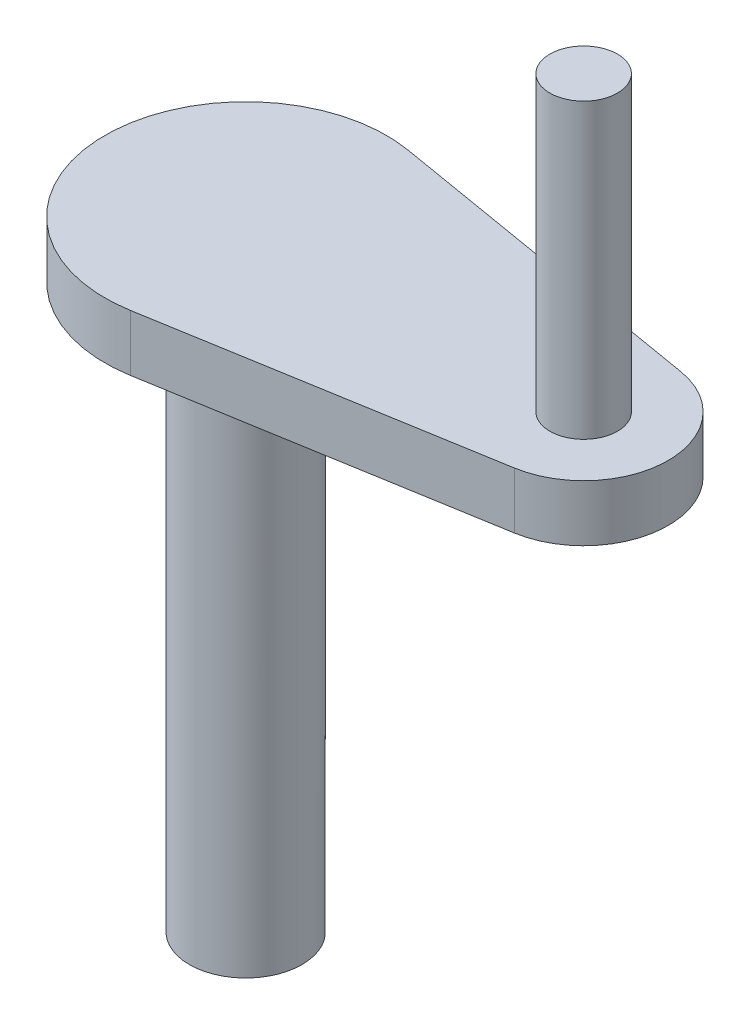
from build123d import *

# Parameters (mm, degrees)
LINEAR_AUSTRAGEN1_DEPTH = 10
SKIZZE3_R               = 6
LINEAR_AUSTRAGEN2_DEPTH = 52
SKIZZE4_R               = 10
LINEAR_AUSTRAGEN3_DEPTH = 100


with BuildPart() as part:
    # Skizze2 → Linear austragen1 (new body)
    with BuildSketch(Plane(origin=(0, 90.376129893, 0), x_dir=(-1, 0, 0), z_dir=(0, 1, 0))):
        with BuildLine():
            Line((17.973666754, 24.65033243), (-40.35966658, 14.790199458))
            ThreePointArc((-40.35966658, 14.790199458), (-49.316105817, 9.682458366), (-52.85966658, 0))
            Line((-52.85966658, 0), (47.14033342, 0))
            ThreePointArc((47.14033342, 0), (38.27776403, 19.094065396), (17.973666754, 24.65033243))
        make_face()
        with BuildLine():
            Line((47.14033342, 0), (-52.85966658, 0))
            ThreePointArc((-52.85966658, 0), (-49.316105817, -9.682458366), (-40.35966658, -14.790199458))
            Line((-40.35966658, -14.790199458), (17.973666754, -24.65033243))
            ThreePointArc((17.973666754, -24.65033243), (38.27776403, -19.094065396), (47.14033342, 0))
        make_face()
    extrude(amount=LINEAR_AUSTRAGEN1_DEPTH)

    # Skizze3 → Linear austragen2 (add)
    with BuildSketch(Plane(origin=(0, 100.376129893, 0), x_dir=(-1, 0, 0), z_dir=(0, 1, 0))):
        with Locations(Location((-37.85966658, 0, 0), (0, 0, 270))):
            Circle(SKIZZE3_R)
    extrude(amount=LINEAR_AUSTRAGEN2_DEPTH)

    # Skizze4 → Linear austragen3 (add)
    with BuildSketch(Plane.XZ.offset(-90.376129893)):
        with Locations(Location((-22.14033342, 0, 0), (0, 0, 90))):
            Circle(SKIZZE4_R)
    extrude(amount=LINEAR_AUSTRAGEN3_DEPTH)


solid = part.part
